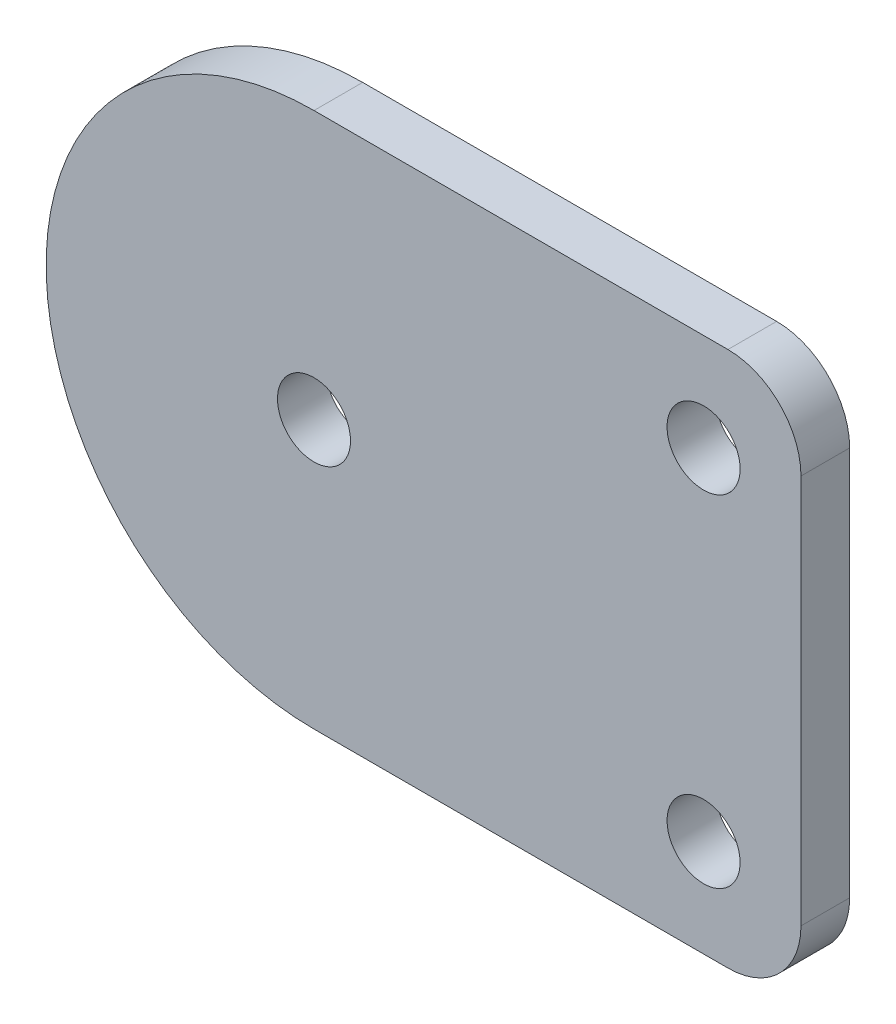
ISO-10303-21;
HEADER;
FILE_DESCRIPTION(('STEP AP214'),'2;1');
FILE_NAME('part.step','',(''),(''),'','','');
FILE_SCHEMA(('AUTOMOTIVE_DESIGN { 1 0 10303 214 1 1 1 1 }'));
ENDSEC;
DATA;
#1=APPLICATION_CONTEXT('core data for automotive mechanical design processes');
#2=APPLICATION_PROTOCOL_DEFINITION('international standard','automotive_design',2000,#1);
#3=PRODUCT_CONTEXT('',#1,'mechanical');
#4=PRODUCT('Part','Part','',(#3));
#5=PRODUCT_RELATED_PRODUCT_CATEGORY('part','',(#4));
#6=PRODUCT_DEFINITION_FORMATION('','',#4);
#7=PRODUCT_DEFINITION_CONTEXT('part definition',#1,'design');
#8=PRODUCT_DEFINITION('design','',#6,#7);
#9=PRODUCT_DEFINITION_SHAPE('','',#8);
#10=(LENGTH_UNIT() NAMED_UNIT(*) SI_UNIT(.MILLI.,.METRE.));
#11=(NAMED_UNIT(*) PLANE_ANGLE_UNIT() SI_UNIT($,.RADIAN.));
#12=(NAMED_UNIT(*) SI_UNIT($,.STERADIAN.) SOLID_ANGLE_UNIT());
#13=UNCERTAINTY_MEASURE_WITH_UNIT(LENGTH_MEASURE(1.E-05),#10,'distance_accuracy_value','');
#14=(GEOMETRIC_REPRESENTATION_CONTEXT(3) GLOBAL_UNCERTAINTY_ASSIGNED_CONTEXT((#13)) GLOBAL_UNIT_ASSIGNED_CONTEXT((#10,
#11,#12)) REPRESENTATION_CONTEXT('',''));
#15=CARTESIAN_POINT('',(0.,0.,0.));
#16=DIRECTION('',(0.,0.,1.));
#17=DIRECTION('',(1.,0.,0.));
#18=AXIS2_PLACEMENT_3D('',#15,#16,#17);
#19=CARTESIAN_POINT('',(0.,0.,2.));
#20=DIRECTION('',(0.,0.,-1.));
#21=DIRECTION('',(-1.,0.,0.));
#22=AXIS2_PLACEMENT_3D('',#19,#20,#21);
#23=PLANE('',#22);
#24=CARTESIAN_POINT('',(16.,7.,2.));
#25=DIRECTION('',(0.,0.,1.));
#26=DIRECTION('',(1.,0.,0.));
#27=AXIS2_PLACEMENT_3D('',#24,#25,#26);
#28=CIRCLE('',#27,1.5);
#29=CARTESIAN_POINT('',(17.5,7.,2.));
#30=VERTEX_POINT('',#29);
#31=EDGE_CURVE('E187',#30,#30,#28,.T.);
#32=ORIENTED_EDGE('',*,*,#31,.F.);
#33=EDGE_LOOP('',(#32));
#34=FACE_BOUND('',#33,.T.);
#35=CARTESIAN_POINT('',(0.,0.,2.));
#36=DIRECTION('',(0.,0.,1.));
#37=DIRECTION('',(-1.,0.,0.));
#38=AXIS2_PLACEMENT_3D('',#35,#36,#37);
#39=CIRCLE('',#38,11.);
#40=CARTESIAN_POINT('',(0.,11.,2.));
#41=VERTEX_POINT('',#40);
#42=CARTESIAN_POINT('',(0.,-11.,2.));
#43=VERTEX_POINT('',#42);
#44=EDGE_CURVE('E112',#41,#43,#39,.T.);
#45=ORIENTED_EDGE('',*,*,#44,.T.);
#46=DIRECTION('',(1.,0.,0.));
#47=VECTOR('',#46,1.);
#48=CARTESIAN_POINT('',(17.,-11.,2.));
#49=LINE('',#48,#47);
#50=CARTESIAN_POINT('',(17.,-11.,2.));
#51=VERTEX_POINT('',#50);
#52=EDGE_CURVE('E93',#43,#51,#49,.T.);
#53=ORIENTED_EDGE('',*,*,#52,.T.);
#54=CARTESIAN_POINT('',(17.,-8.,2.));
#55=DIRECTION('',(0.,0.,1.));
#56=DIRECTION('',(-1.,0.,0.));
#57=AXIS2_PLACEMENT_3D('',#54,#55,#56);
#58=CIRCLE('',#57,3.);
#59=CARTESIAN_POINT('',(20.,-7.99999999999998,2.));
#60=VERTEX_POINT('',#59);
#61=EDGE_CURVE('E115',#51,#60,#58,.T.);
#62=ORIENTED_EDGE('',*,*,#61,.T.);
#63=DIRECTION('',(0.,1.,0.));
#64=VECTOR('',#63,1.);
#65=CARTESIAN_POINT('',(20.,7.99999999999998,2.));
#66=LINE('',#65,#64);
#67=CARTESIAN_POINT('',(20.,7.99999999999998,2.));
#68=VERTEX_POINT('',#67);
#69=EDGE_CURVE('E117',#60,#68,#66,.T.);
#70=ORIENTED_EDGE('',*,*,#69,.T.);
#71=CARTESIAN_POINT('',(17.,8.,2.));
#72=DIRECTION('',(0.,0.,1.));
#73=DIRECTION('',(1.,0.,0.));
#74=AXIS2_PLACEMENT_3D('',#71,#72,#73);
#75=CIRCLE('',#74,3.);
#76=CARTESIAN_POINT('',(17.,11.,2.));
#77=VERTEX_POINT('',#76);
#78=EDGE_CURVE('E46',#68,#77,#75,.T.);
#79=ORIENTED_EDGE('',*,*,#78,.T.);
#80=DIRECTION('',(-1.,0.,0.));
#81=VECTOR('',#80,1.);
#82=CARTESIAN_POINT('',(0.,11.,2.));
#83=LINE('',#82,#81);
#84=EDGE_CURVE('E41',#77,#41,#83,.T.);
#85=ORIENTED_EDGE('',*,*,#84,.T.);
#86=EDGE_LOOP('',(#45,#53,#62,#70,#79,#85));
#87=FACE_BOUND('',#86,.T.);
#88=CARTESIAN_POINT('',(0.,0.,2.));
#89=DIRECTION('',(0.,0.,1.));
#90=DIRECTION('',(1.,0.,0.));
#91=AXIS2_PLACEMENT_3D('',#88,#89,#90);
#92=CIRCLE('',#91,1.5);
#93=CARTESIAN_POINT('',(1.5,0.,2.));
#94=VERTEX_POINT('',#93);
#95=EDGE_CURVE('E98',#94,#94,#92,.T.);
#96=ORIENTED_EDGE('',*,*,#95,.F.);
#97=EDGE_LOOP('',(#96));
#98=FACE_BOUND('',#97,.T.);
#99=CARTESIAN_POINT('',(16.,-7.,2.));
#100=DIRECTION('',(0.,0.,1.));
#101=DIRECTION('',(-1.,0.,0.));
#102=AXIS2_PLACEMENT_3D('',#99,#100,#101);
#103=CIRCLE('',#102,1.5);
#104=CARTESIAN_POINT('',(14.5,-7.,2.));
#105=VERTEX_POINT('',#104);
#106=EDGE_CURVE('E176',#105,#105,#103,.T.);
#107=ORIENTED_EDGE('',*,*,#106,.F.);
#108=EDGE_LOOP('',(#107));
#109=FACE_BOUND('',#108,.T.);
#110=ADVANCED_FACE('F26',(#34,#87,#98,#109),#23,.F.);
#111=CARTESIAN_POINT('',(0.,0.,0.));
#112=DIRECTION('',(0.,0.,-1.));
#113=DIRECTION('',(-1.,0.,0.));
#114=AXIS2_PLACEMENT_3D('',#111,#112,#113);
#115=PLANE('',#114);
#116=CARTESIAN_POINT('',(16.,7.,0.));
#117=DIRECTION('',(0.,0.,1.));
#118=DIRECTION('',(1.,0.,0.));
#119=AXIS2_PLACEMENT_3D('',#116,#117,#118);
#120=CIRCLE('',#119,1.5);
#121=CARTESIAN_POINT('',(17.5,7.,0.));
#122=VERTEX_POINT('',#121);
#123=EDGE_CURVE('E182',#122,#122,#120,.T.);
#124=ORIENTED_EDGE('',*,*,#123,.T.);
#125=EDGE_LOOP('',(#124));
#126=FACE_BOUND('',#125,.T.);
#127=CARTESIAN_POINT('',(0.,0.,0.));
#128=DIRECTION('',(0.,0.,1.));
#129=DIRECTION('',(-1.,0.,0.));
#130=AXIS2_PLACEMENT_3D('',#127,#128,#129);
#131=CIRCLE('',#130,11.);
#132=CARTESIAN_POINT('',(0.,11.,0.));
#133=VERTEX_POINT('',#132);
#134=CARTESIAN_POINT('',(0.,-11.,0.));
#135=VERTEX_POINT('',#134);
#136=EDGE_CURVE('E84',#133,#135,#131,.T.);
#137=ORIENTED_EDGE('',*,*,#136,.F.);
#138=DIRECTION('',(-1.,0.,0.));
#139=VECTOR('',#138,1.);
#140=CARTESIAN_POINT('',(0.,11.,0.));
#141=LINE('',#140,#139);
#142=CARTESIAN_POINT('',(17.,11.,0.));
#143=VERTEX_POINT('',#142);
#144=EDGE_CURVE('E110',#143,#133,#141,.T.);
#145=ORIENTED_EDGE('',*,*,#144,.F.);
#146=CARTESIAN_POINT('',(17.,8.,0.));
#147=DIRECTION('',(0.,0.,1.));
#148=DIRECTION('',(1.,0.,0.));
#149=AXIS2_PLACEMENT_3D('',#146,#147,#148);
#150=CIRCLE('',#149,3.);
#151=CARTESIAN_POINT('',(20.,7.99999999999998,0.));
#152=VERTEX_POINT('',#151);
#153=EDGE_CURVE('E108',#152,#143,#150,.T.);
#154=ORIENTED_EDGE('',*,*,#153,.F.);
#155=DIRECTION('',(0.,1.,0.));
#156=VECTOR('',#155,1.);
#157=CARTESIAN_POINT('',(20.,7.99999999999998,0.));
#158=LINE('',#157,#156);
#159=CARTESIAN_POINT('',(20.,-7.99999999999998,0.));
#160=VERTEX_POINT('',#159);
#161=EDGE_CURVE('E106',#160,#152,#158,.T.);
#162=ORIENTED_EDGE('',*,*,#161,.F.);
#163=CARTESIAN_POINT('',(17.,-8.,0.));
#164=DIRECTION('',(0.,0.,1.));
#165=DIRECTION('',(-1.,0.,0.));
#166=AXIS2_PLACEMENT_3D('',#163,#164,#165);
#167=CIRCLE('',#166,3.);
#168=CARTESIAN_POINT('',(17.,-11.,0.));
#169=VERTEX_POINT('',#168);
#170=EDGE_CURVE('E86',#169,#160,#167,.T.);
#171=ORIENTED_EDGE('',*,*,#170,.F.);
#172=DIRECTION('',(1.,0.,0.));
#173=VECTOR('',#172,1.);
#174=CARTESIAN_POINT('',(17.,-11.,0.));
#175=LINE('',#174,#173);
#176=EDGE_CURVE('E79',#135,#169,#175,.T.);
#177=ORIENTED_EDGE('',*,*,#176,.F.);
#178=EDGE_LOOP('',(#137,#145,#154,#162,#171,#177));
#179=FACE_BOUND('',#178,.T.);
#180=CARTESIAN_POINT('',(0.,0.,0.));
#181=DIRECTION('',(0.,0.,1.));
#182=DIRECTION('',(1.,0.,0.));
#183=AXIS2_PLACEMENT_3D('',#180,#181,#182);
#184=CIRCLE('',#183,1.5);
#185=CARTESIAN_POINT('',(1.5,0.,0.));
#186=VERTEX_POINT('',#185);
#187=EDGE_CURVE('E101',#186,#186,#184,.T.);
#188=ORIENTED_EDGE('',*,*,#187,.T.);
#189=EDGE_LOOP('',(#188));
#190=FACE_BOUND('',#189,.T.);
#191=CARTESIAN_POINT('',(16.,-7.,0.));
#192=DIRECTION('',(0.,0.,1.));
#193=DIRECTION('',(-1.,0.,0.));
#194=AXIS2_PLACEMENT_3D('',#191,#192,#193);
#195=CIRCLE('',#194,1.5);
#196=CARTESIAN_POINT('',(14.5,-7.,0.));
#197=VERTEX_POINT('',#196);
#198=EDGE_CURVE('E179',#197,#197,#195,.T.);
#199=ORIENTED_EDGE('',*,*,#198,.T.);
#200=EDGE_LOOP('',(#199));
#201=FACE_BOUND('',#200,.T.);
#202=ADVANCED_FACE('F80',(#126,#179,#190,#201),#115,.T.);
#203=CARTESIAN_POINT('',(0.,0.,2.));
#204=DIRECTION('',(0.,0.,-1.));
#205=DIRECTION('',(-1.,0.,0.));
#206=AXIS2_PLACEMENT_3D('',#203,#204,#205);
#207=CYLINDRICAL_SURFACE('',#206,11.);
#208=ORIENTED_EDGE('',*,*,#136,.T.);
#209=DIRECTION('',(0.,0.,-1.));
#210=VECTOR('',#209,1.);
#211=CARTESIAN_POINT('',(0.,-11.,2.));
#212=LINE('',#211,#210);
#213=EDGE_CURVE('E11',#43,#135,#212,.T.);
#214=ORIENTED_EDGE('',*,*,#213,.F.);
#215=ORIENTED_EDGE('',*,*,#44,.F.);
#216=DIRECTION('',(0.,0.,-1.));
#217=VECTOR('',#216,1.);
#218=CARTESIAN_POINT('',(0.,11.,2.));
#219=LINE('',#218,#217);
#220=EDGE_CURVE('E97',#41,#133,#219,.T.);
#221=ORIENTED_EDGE('',*,*,#220,.T.);
#222=EDGE_LOOP('',(#208,#214,#215,#221));
#223=FACE_BOUND('',#222,.T.);
#224=ADVANCED_FACE('F28',(#223),#207,.T.);
#225=CARTESIAN_POINT('',(17.,-11.,2.));
#226=DIRECTION('',(0.,1.,0.));
#227=DIRECTION('',(0.,0.,1.));
#228=AXIS2_PLACEMENT_3D('',#225,#226,#227);
#229=PLANE('',#228);
#230=ORIENTED_EDGE('',*,*,#176,.T.);
#231=DIRECTION('',(0.,0.,-1.));
#232=VECTOR('',#231,1.);
#233=CARTESIAN_POINT('',(17.,-11.,2.));
#234=LINE('',#233,#232);
#235=EDGE_CURVE('E34',#51,#169,#234,.T.);
#236=ORIENTED_EDGE('',*,*,#235,.F.);
#237=ORIENTED_EDGE('',*,*,#52,.F.);
#238=ORIENTED_EDGE('',*,*,#213,.T.);
#239=EDGE_LOOP('',(#230,#236,#237,#238));
#240=FACE_BOUND('',#239,.T.);
#241=ADVANCED_FACE('F92',(#240),#229,.F.);
#242=CARTESIAN_POINT('',(17.,-8.,2.));
#243=DIRECTION('',(0.,0.,-1.));
#244=DIRECTION('',(-1.,0.,0.));
#245=AXIS2_PLACEMENT_3D('',#242,#243,#244);
#246=CYLINDRICAL_SURFACE('',#245,3.);
#247=ORIENTED_EDGE('',*,*,#170,.T.);
#248=DIRECTION('',(0.,0.,-1.));
#249=VECTOR('',#248,1.);
#250=CARTESIAN_POINT('',(20.,-7.99999999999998,2.));
#251=LINE('',#250,#249);
#252=EDGE_CURVE('E128',#60,#160,#251,.T.);
#253=ORIENTED_EDGE('',*,*,#252,.F.);
#254=ORIENTED_EDGE('',*,*,#61,.F.);
#255=ORIENTED_EDGE('',*,*,#235,.T.);
#256=EDGE_LOOP('',(#247,#253,#254,#255));
#257=FACE_BOUND('',#256,.T.);
#258=ADVANCED_FACE('F132',(#257),#246,.T.);
#259=CARTESIAN_POINT('',(20.,7.99999999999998,2.));
#260=DIRECTION('',(-1.,0.,0.));
#261=DIRECTION('',(0.,0.,1.));
#262=AXIS2_PLACEMENT_3D('',#259,#260,#261);
#263=PLANE('',#262);
#264=ORIENTED_EDGE('',*,*,#161,.T.);
#265=DIRECTION('',(0.,0.,-1.));
#266=VECTOR('',#265,1.);
#267=CARTESIAN_POINT('',(20.,7.99999999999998,2.));
#268=LINE('',#267,#266);
#269=EDGE_CURVE('E125',#68,#152,#268,.T.);
#270=ORIENTED_EDGE('',*,*,#269,.F.);
#271=ORIENTED_EDGE('',*,*,#69,.F.);
#272=ORIENTED_EDGE('',*,*,#252,.T.);
#273=EDGE_LOOP('',(#264,#270,#271,#272));
#274=FACE_BOUND('',#273,.T.);
#275=ADVANCED_FACE('F138',(#274),#263,.F.);
#276=CARTESIAN_POINT('',(17.,8.,2.));
#277=DIRECTION('',(0.,0.,-1.));
#278=DIRECTION('',(-1.,0.,0.));
#279=AXIS2_PLACEMENT_3D('',#276,#277,#278);
#280=CYLINDRICAL_SURFACE('',#279,3.);
#281=ORIENTED_EDGE('',*,*,#153,.T.);
#282=DIRECTION('',(0.,0.,-1.));
#283=VECTOR('',#282,1.);
#284=CARTESIAN_POINT('',(17.,11.,2.));
#285=LINE('',#284,#283);
#286=EDGE_CURVE('E122',#77,#143,#285,.T.);
#287=ORIENTED_EDGE('',*,*,#286,.F.);
#288=ORIENTED_EDGE('',*,*,#78,.F.);
#289=ORIENTED_EDGE('',*,*,#269,.T.);
#290=EDGE_LOOP('',(#281,#287,#288,#289));
#291=FACE_BOUND('',#290,.T.);
#292=ADVANCED_FACE('F141',(#291),#280,.T.);
#293=CARTESIAN_POINT('',(0.,11.,2.));
#294=DIRECTION('',(0.,-1.,0.));
#295=DIRECTION('',(0.,0.,-1.));
#296=AXIS2_PLACEMENT_3D('',#293,#294,#295);
#297=PLANE('',#296);
#298=ORIENTED_EDGE('',*,*,#144,.T.);
#299=ORIENTED_EDGE('',*,*,#220,.F.);
#300=ORIENTED_EDGE('',*,*,#84,.F.);
#301=ORIENTED_EDGE('',*,*,#286,.T.);
#302=EDGE_LOOP('',(#298,#299,#300,#301));
#303=FACE_BOUND('',#302,.T.);
#304=ADVANCED_FACE('F143',(#303),#297,.F.);
#305=CARTESIAN_POINT('',(0.,0.,2.));
#306=DIRECTION('',(0.,0.,-1.));
#307=DIRECTION('',(-1.,0.,0.));
#308=AXIS2_PLACEMENT_3D('',#305,#306,#307);
#309=CYLINDRICAL_SURFACE('',#308,1.5);
#310=ORIENTED_EDGE('',*,*,#95,.T.);
#311=EDGE_LOOP('',(#310));
#312=FACE_BOUND('',#311,.T.);
#313=ORIENTED_EDGE('',*,*,#187,.F.);
#314=EDGE_LOOP('',(#313));
#315=FACE_BOUND('',#314,.T.);
#316=ADVANCED_FACE('F145',(#312,#315),#309,.F.);
#317=CARTESIAN_POINT('',(16.,7.,2.));
#318=DIRECTION('',(0.,0.,-1.));
#319=DIRECTION('',(-1.,0.,0.));
#320=AXIS2_PLACEMENT_3D('',#317,#318,#319);
#321=CYLINDRICAL_SURFACE('',#320,1.5);
#322=ORIENTED_EDGE('',*,*,#31,.T.);
#323=EDGE_LOOP('',(#322));
#324=FACE_BOUND('',#323,.T.);
#325=ORIENTED_EDGE('',*,*,#123,.F.);
#326=EDGE_LOOP('',(#325));
#327=FACE_BOUND('',#326,.T.);
#328=ADVANCED_FACE('F151',(#324,#327),#321,.F.);
#329=CARTESIAN_POINT('',(16.,-7.,2.));
#330=DIRECTION('',(0.,0.,-1.));
#331=DIRECTION('',(-1.,0.,0.));
#332=AXIS2_PLACEMENT_3D('',#329,#330,#331);
#333=CYLINDRICAL_SURFACE('',#332,1.5);
#334=ORIENTED_EDGE('',*,*,#106,.T.);
#335=EDGE_LOOP('',(#334));
#336=FACE_BOUND('',#335,.T.);
#337=ORIENTED_EDGE('',*,*,#198,.F.);
#338=EDGE_LOOP('',(#337));
#339=FACE_BOUND('',#338,.T.);
#340=ADVANCED_FACE('F167',(#336,#339),#333,.F.);
#341=CLOSED_SHELL('',(#110,#202,#224,#241,#258,#275,#292,#304,#316,#328,#340));
#342=MANIFOLD_SOLID_BREP('B2',#341);
#343=ADVANCED_BREP_SHAPE_REPRESENTATION('',(#18,#342),#14);
#344=SHAPE_DEFINITION_REPRESENTATION(#9,#343);
ENDSEC;
END-ISO-10303-21;
